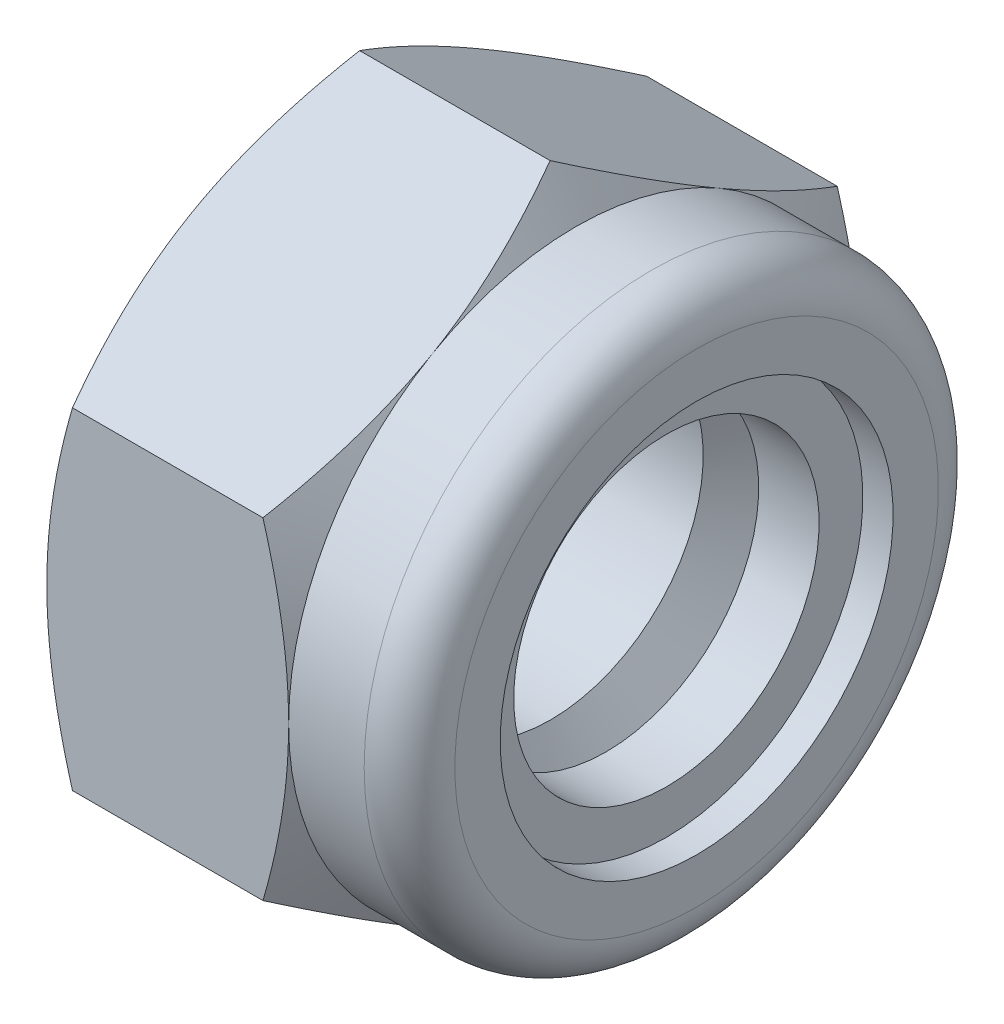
ISO-10303-21;
HEADER;
FILE_DESCRIPTION(('STEP AP214'),'2;1');
FILE_NAME('part.step','',(''),(''),'','','');
FILE_SCHEMA(('AUTOMOTIVE_DESIGN { 1 0 10303 214 1 1 1 1 }'));
ENDSEC;
DATA;
#1=APPLICATION_CONTEXT('core data for automotive mechanical design processes');
#2=APPLICATION_PROTOCOL_DEFINITION('international standard','automotive_design',2000,#1);
#3=PRODUCT_CONTEXT('',#1,'mechanical');
#4=PRODUCT('Part','Part','',(#3));
#5=PRODUCT_RELATED_PRODUCT_CATEGORY('part','',(#4));
#6=PRODUCT_DEFINITION_FORMATION('','',#4);
#7=PRODUCT_DEFINITION_CONTEXT('part definition',#1,'design');
#8=PRODUCT_DEFINITION('design','',#6,#7);
#9=PRODUCT_DEFINITION_SHAPE('','',#8);
#10=(LENGTH_UNIT() NAMED_UNIT(*) SI_UNIT(.MILLI.,.METRE.));
#11=(NAMED_UNIT(*) PLANE_ANGLE_UNIT() SI_UNIT($,.RADIAN.));
#12=(NAMED_UNIT(*) SI_UNIT($,.STERADIAN.) SOLID_ANGLE_UNIT());
#13=UNCERTAINTY_MEASURE_WITH_UNIT(LENGTH_MEASURE(1.E-05),#10,'distance_accuracy_value','');
#14=(GEOMETRIC_REPRESENTATION_CONTEXT(3) GLOBAL_UNCERTAINTY_ASSIGNED_CONTEXT((#13)) GLOBAL_UNIT_ASSIGNED_CONTEXT((#10,
#11,#12)) REPRESENTATION_CONTEXT('',''));
#15=CARTESIAN_POINT('',(0.,0.,0.));
#16=DIRECTION('',(0.,0.,1.));
#17=DIRECTION('',(1.,0.,0.));
#18=AXIS2_PLACEMENT_3D('',#15,#16,#17);
#19=CARTESIAN_POINT('',(8.,0.,0.));
#20=DIRECTION('',(-1.,0.,0.));
#21=DIRECTION('',(0.,-1.,0.));
#22=AXIS2_PLACEMENT_3D('',#19,#20,#21);
#23=CONICAL_SURFACE('',#22,9.5,1.0471975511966);
#24=CARTESIAN_POINT('',(7.15142755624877,-10.9697705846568,-0.0002));
#25=CARTESIAN_POINT('',(7.22102656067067,-10.8492020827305,0.2086307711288));
#26=CARTESIAN_POINT('',(7.28746669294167,-10.7281840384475,0.418240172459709));
#27=CARTESIAN_POINT('',(7.41315271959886,-10.4851774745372,0.839139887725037));
#28=CARTESIAN_POINT('',(7.47239624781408,-10.3631886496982,1.05043073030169));
#29=CARTESIAN_POINT('',(7.63818542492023,-9.99525656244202,1.68770779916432));
#30=CARTESIAN_POINT('',(7.73248555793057,-9.74786083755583,2.11620976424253));
#31=CARTESIAN_POINT('',(7.84306129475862,-9.37764446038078,2.75744333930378));
#32=CARTESIAN_POINT('',(7.8745601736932,-9.25592985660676,2.96825921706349));
#33=CARTESIAN_POINT('',(7.92738179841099,-9.01193711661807,3.39086703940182));
#34=CARTESIAN_POINT('',(7.9487043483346,-8.88965896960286,3.60265900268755));
#35=CARTESIAN_POINT('',(7.98062697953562,-8.64489870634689,4.0265962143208));
#36=CARTESIAN_POINT('',(7.99123980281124,-8.5224170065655,4.23874074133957));
#37=CARTESIAN_POINT('',(8.00151746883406,-8.27734047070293,4.66322575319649));
#38=CARTESIAN_POINT('',(8.00118264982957,-8.15474563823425,4.87556623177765));
#39=CARTESIAN_POINT('',(7.99032663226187,-7.92555157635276,5.27254199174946));
#40=CARTESIAN_POINT('',(7.98112973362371,-7.81893617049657,5.45720529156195));
#41=CARTESIAN_POINT('',(7.95463460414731,-7.60595470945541,5.82610000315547));
#42=CARTESIAN_POINT('',(7.93733580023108,-7.49958867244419,6.01033138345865));
#43=CARTESIAN_POINT('',(7.87369551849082,-7.18090270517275,6.56231167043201));
#44=CARTESIAN_POINT('',(7.81561809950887,-6.96914687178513,6.92908353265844));
#45=CARTESIAN_POINT('',(7.67042398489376,-6.54338898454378,7.66651782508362));
#46=CARTESIAN_POINT('',(7.58269183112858,-6.32944126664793,8.03708614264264));
#47=CARTESIAN_POINT('',(7.38357626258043,-5.90473630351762,8.77269671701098));
#48=CARTESIAN_POINT('',(7.27223961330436,-5.69397361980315,9.137748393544));
#49=CARTESIAN_POINT('',(7.15142755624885,-5.48471208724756,9.5002));
#50=B_SPLINE_CURVE_WITH_KNOTS('',3,(#24,#25,#26,#27,#28,#29,#30,#31,#32,#33,#34,#35,#36,#37,#38,
#39,#40,#41,#42,#43,#44,#45,#46,#47,#48,#49),.UNSPECIFIED.,.F.,.F.,(4,2,2,2,2,2,2,2,2,2,2,2,4),
(0.,0.752880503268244,1.50600787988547,3.01546870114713,3.75167336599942,4.4878921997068,
5.22323407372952,5.95855322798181,6.59868084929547,7.23885375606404,8.52010929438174,
9.82978009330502,11.1368800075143),.UNSPECIFIED.);
#51=CARTESIAN_POINT('',(7.15149422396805,-10.969655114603,0.));
#52=VERTEX_POINT('',#51);
#53=CARTESIAN_POINT('',(7.99999999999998,-8.22724133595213,4.75000000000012));
#54=VERTEX_POINT('',#53);
#55=EDGE_CURVE('E230',#52,#54,#50,.T.);
#56=ORIENTED_EDGE('',*,*,#55,.F.);
#57=CARTESIAN_POINT('',(7.15142755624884,-5.48471208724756,-9.5002));
#58=CARTESIAN_POINT('',(7.22102656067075,-5.60528058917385,-9.2913692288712));
#59=CARTESIAN_POINT('',(7.28746669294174,-5.72629863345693,-9.0817598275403));
#60=CARTESIAN_POINT('',(7.41315271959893,-5.96930519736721,-8.66086011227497));
#61=CARTESIAN_POINT('',(7.47239624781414,-6.09129402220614,-8.44956926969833));
#62=CARTESIAN_POINT('',(7.63818542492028,-6.45922610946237,-7.8122922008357));
#63=CARTESIAN_POINT('',(7.73248555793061,-6.70662183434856,-7.38379023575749));
#64=CARTESIAN_POINT('',(7.84306129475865,-7.0768382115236,-6.74255666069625));
#65=CARTESIAN_POINT('',(7.87456017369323,-7.19855281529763,-6.53174078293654));
#66=CARTESIAN_POINT('',(7.92738179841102,-7.44254555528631,-6.10913296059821));
#67=CARTESIAN_POINT('',(7.94870434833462,-7.56482370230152,-5.89734099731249));
#68=CARTESIAN_POINT('',(7.98062697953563,-7.80958396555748,-5.47340378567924));
#69=CARTESIAN_POINT('',(7.99123980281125,-7.93206566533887,-5.26125925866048));
#70=CARTESIAN_POINT('',(8.00151746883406,-8.17714220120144,-4.83677424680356));
#71=CARTESIAN_POINT('',(8.00118264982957,-8.29973703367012,-4.6244337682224));
#72=CARTESIAN_POINT('',(7.99032663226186,-8.52893109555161,-4.22745800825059));
#73=CARTESIAN_POINT('',(7.9811297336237,-8.6355465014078,-4.0427947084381));
#74=CARTESIAN_POINT('',(7.95463460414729,-8.84852796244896,-3.67389999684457));
#75=CARTESIAN_POINT('',(7.93733580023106,-8.95489399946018,-3.48966861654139));
#76=CARTESIAN_POINT('',(7.87369551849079,-9.27357996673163,-2.93768832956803));
#77=CARTESIAN_POINT('',(7.81561809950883,-9.48533580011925,-2.57091646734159));
#78=CARTESIAN_POINT('',(7.67042398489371,-9.9110936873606,-1.8334821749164));
#79=CARTESIAN_POINT('',(7.58269183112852,-10.1250414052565,-1.46291385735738));
#80=CARTESIAN_POINT('',(7.38357626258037,-10.5497463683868,-0.727303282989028));
#81=CARTESIAN_POINT('',(7.27223961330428,-10.7605090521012,-0.362251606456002));
#82=CARTESIAN_POINT('',(7.15142755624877,-10.9697705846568,0.000200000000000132));
#83=B_SPLINE_CURVE_WITH_KNOTS('',3,(#57,#58,#59,#60,#61,#62,#63,#64,#65,#66,#67,#68,#69,#70,#71,
#72,#73,#74,#75,#76,#77,#78,#79,#80,#81,#82),.UNSPECIFIED.,.F.,.F.,(4,2,2,2,2,2,2,2,2,2,2,2,4),
(0.,0.752880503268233,1.50600787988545,3.01546870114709,3.75167336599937,4.48789219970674,
5.22323407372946,5.95855322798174,6.59868084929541,7.23885375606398,8.52010929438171,
9.829780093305,11.1368800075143),.UNSPECIFIED.);
#84=CARTESIAN_POINT('',(7.99999999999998,-8.22724133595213,-4.75000000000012));
#85=VERTEX_POINT('',#84);
#86=EDGE_CURVE('E335',#85,#52,#83,.T.);
#87=ORIENTED_EDGE('',*,*,#86,.F.);
#88=CARTESIAN_POINT('',(8.,0.,0.));
#89=DIRECTION('',(1.,0.,0.));
#90=DIRECTION('',(0.,1.,0.));
#91=AXIS2_PLACEMENT_3D('',#88,#89,#90);
#92=CIRCLE('',#91,9.5);
#93=EDGE_CURVE('E361',#54,#85,#92,.T.);
#94=ORIENTED_EDGE('',*,*,#93,.F.);
#95=EDGE_LOOP('',(#56,#87,#94));
#96=FACE_BOUND('',#95,.T.);
#97=ADVANCED_FACE('F35',(#96),#23,.T.);
#98=CARTESIAN_POINT('',(7.15149422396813,-5.4848275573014,9.5));
#99=VERTEX_POINT('',#98);
#100=EDGE_CURVE('E231',#54,#99,#50,.T.);
#101=ORIENTED_EDGE('',*,*,#100,.F.);
#102=CARTESIAN_POINT('',(8.,0.,9.5));
#103=VERTEX_POINT('',#102);
#104=EDGE_CURVE('E248',#103,#54,#92,.T.);
#105=ORIENTED_EDGE('',*,*,#104,.F.);
#106=CARTESIAN_POINT('',(3.32587526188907,-14.8109059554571,9.5));
#107=CARTESIAN_POINT('',(3.42684938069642,-14.6031243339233,9.5));
#108=CARTESIAN_POINT('',(3.52732586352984,-14.3951009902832,9.5));
#109=CARTESIAN_POINT('',(3.72717100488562,-13.9785204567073,9.5));
#110=CARTESIAN_POINT('',(3.82653965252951,-13.7699632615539,9.5));
#111=CARTESIAN_POINT('',(4.12284070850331,-13.1433608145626,9.5));
#112=CARTESIAN_POINT('',(4.31793886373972,-12.7244449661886,9.5));
#113=CARTESIAN_POINT('',(4.70311268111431,-11.8815931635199,9.5));
#114=CARTESIAN_POINT('',(4.89315588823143,-11.4576423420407,9.5));
#115=CARTESIAN_POINT('',(5.26557199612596,-10.6063967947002,9.5));
#116=CARTESIAN_POINT('',(5.44794525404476,-10.1791022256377,9.5));
#117=CARTESIAN_POINT('',(5.80882953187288,-9.30637765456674,9.5));
#118=CARTESIAN_POINT('',(5.98701680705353,-8.86081304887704,9.5));
#119=CARTESIAN_POINT('',(6.33009368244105,-7.96450097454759,9.5));
#120=CARTESIAN_POINT('',(6.49498180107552,-7.51375293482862,9.5));
#121=CARTESIAN_POINT('',(6.80718793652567,-6.60717020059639,9.5));
#122=CARTESIAN_POINT('',(6.95454086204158,-6.1513476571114,9.5));
#123=CARTESIAN_POINT('',(7.22700160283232,-5.23318024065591,9.5));
#124=CARTESIAN_POINT('',(7.35211634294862,-4.77083744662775,9.5));
#125=CARTESIAN_POINT('',(7.57346743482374,-3.84188418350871,9.5));
#126=CARTESIAN_POINT('',(7.66986394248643,-3.37531292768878,9.5));
#127=CARTESIAN_POINT('',(7.78878967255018,-2.67114536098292,9.5));
#128=CARTESIAN_POINT('',(7.82415499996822,-2.43568762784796,9.5));
#129=CARTESIAN_POINT('',(7.88563753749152,-1.96357546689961,9.5));
#130=CARTESIAN_POINT('',(7.9117556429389,-1.72692115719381,9.5));
#131=CARTESIAN_POINT('',(7.95389172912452,-1.25585831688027,9.5));
#132=CARTESIAN_POINT('',(7.97003840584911,-1.02146134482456,9.5));
#133=CARTESIAN_POINT('',(7.99240100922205,-0.552194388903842,9.5));
#134=CARTESIAN_POINT('',(7.99861710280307,-0.317324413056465,9.5));
#135=CARTESIAN_POINT('',(8.00096998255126,0.152467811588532,9.5));
#136=CARTESIAN_POINT('',(7.99710676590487,0.387390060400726,9.5));
#137=CARTESIAN_POINT('',(7.97939653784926,0.856860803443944,9.5));
#138=CARTESIAN_POINT('',(7.96554904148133,1.09140927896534,9.5));
#139=CARTESIAN_POINT('',(7.9207543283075,1.65276277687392,9.5));
#140=CARTESIAN_POINT('',(7.8851998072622,1.97920812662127,9.5));
#141=CARTESIAN_POINT('',(7.79667223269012,2.62971151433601,9.5));
#142=CARTESIAN_POINT('',(7.74369687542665,2.95376923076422,9.5));
#143=CARTESIAN_POINT('',(7.56144549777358,3.92197165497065,9.5));
#144=CARTESIAN_POINT('',(7.40887618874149,4.56179172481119,9.5));
#145=CARTESIAN_POINT('',(7.1438532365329,5.51856895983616,9.5));
#146=CARTESIAN_POINT('',(7.0482419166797,5.84047729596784,9.5));
#147=CARTESIAN_POINT('',(6.84697300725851,6.48116865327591,9.5));
#148=CARTESIAN_POINT('',(6.74131535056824,6.7999516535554,9.5));
#149=CARTESIAN_POINT('',(6.52165855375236,7.43449001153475,9.5));
#150=CARTESIAN_POINT('',(6.4076620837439,7.7502463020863,9.5));
#151=CARTESIAN_POINT('',(6.17268042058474,8.37913534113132,9.5));
#152=CARTESIAN_POINT('',(6.05169531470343,8.69226812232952,9.5));
#153=CARTESIAN_POINT('',(5.75526512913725,9.43864227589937,9.5));
#154=CARTESIAN_POINT('',(5.57708060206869,9.87079371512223,9.5));
#155=CARTESIAN_POINT('',(5.2118441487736,10.7313446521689,9.5));
#156=CARTESIAN_POINT('',(5.02479164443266,11.1597439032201,9.5));
#157=CARTESIAN_POINT('',(4.64361839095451,12.013500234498,9.5));
#158=CARTESIAN_POINT('',(4.44949596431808,12.4388565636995,9.5));
#159=CARTESIAN_POINT('',(4.05562918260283,13.2869398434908,9.5));
#160=CARTESIAN_POINT('',(3.85588495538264,13.7096668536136,9.5));
#161=CARTESIAN_POINT('',(3.45160745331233,14.5534173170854,9.5));
#162=CARTESIAN_POINT('',(3.24706894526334,14.9744382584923,9.5));
#163=CARTESIAN_POINT('',(2.83425219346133,15.8146424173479,9.5));
#164=CARTESIAN_POINT('',(2.62597393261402,16.2338256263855,9.5));
#165=CARTESIAN_POINT('',(2.20635515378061,17.0705826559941,9.5));
#166=CARTESIAN_POINT('',(1.99501506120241,17.488156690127,9.5));
#167=CARTESIAN_POINT('',(1.56975130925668,18.3219878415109,9.5));
#168=CARTESIAN_POINT('',(1.35582763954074,18.7382449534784,9.5));
#169=CARTESIAN_POINT('',(0.747658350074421,19.9140885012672,9.5));
#170=CARTESIAN_POINT('',(0.350874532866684,20.672362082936,9.5));
#171=CARTESIAN_POINT('',(-0.448092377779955,22.1860890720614,9.5));
#172=CARTESIAN_POINT('',(-0.850275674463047,22.9415423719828,9.5));
#173=CARTESIAN_POINT('',(-1.65771725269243,24.4482793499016,9.5));
#174=CARTESIAN_POINT('',(-2.06296484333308,25.199568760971,9.5));
#175=CARTESIAN_POINT('',(-2.67322884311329,26.3251763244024,9.5));
#176=CARTESIAN_POINT('',(-2.87704315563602,26.700147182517,9.5));
#177=CARTESIAN_POINT('',(-3.28538920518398,27.4496973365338,9.5));
#178=CARTESIAN_POINT('',(-3.4899209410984,27.8242766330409,9.5));
#179=CARTESIAN_POINT('',(-3.6947697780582,28.1986824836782,9.5));
#180=B_SPLINE_CURVE_WITH_KNOTS('',3,(#106,#107,#108,#109,#110,#111,#112,#113,#114,#115,#116,
#117,#118,#119,#120,#121,#122,#123,#124,#125,#126,#127,#128,#129,#130,#131,#132,#133,#134,#135,
#136,#137,#138,#139,#140,#141,#142,#143,#144,#145,#146,#147,#148,#149,#150,#151,#152,#153,#154,
#155,#156,#157,#158,#159,#160,#161,#162,#163,#164,#165,#166,#167,#168,#169,#170,#171,#172,#173,
#174,#175,#176,#177,#178,#179),.UNSPECIFIED.,.F.,.F.,(4,2,2,2,2,2,2,2,2,2,2,2,2,2,2,2,2,2,2,2,2,
2,2,2,2,2,2,2,2,2,2,2,2,2,2,2,4),(0.,0.69305055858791,1.38610791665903,2.77242373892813,
4.16615644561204,5.55982418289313,6.99927980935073,8.43889557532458,9.87559566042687,
11.3118475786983,12.7399330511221,13.4540765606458,14.1681509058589,14.8728051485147,
15.5774475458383,16.2820901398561,16.9867669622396,17.9713396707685,18.9560426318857,
20.9265098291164,21.9338457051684,22.9411883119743,23.9482097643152,24.9552186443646,
26.3574183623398,27.7597096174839,29.162335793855,30.5649300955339,31.9691341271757,
33.3733445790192,34.7773617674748,36.1813845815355,38.7487911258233,41.3162945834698,
43.877133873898,45.1574812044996,46.4378265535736),.UNSPECIFIED.);
#181=EDGE_CURVE('E139',#99,#103,#180,.T.);
#182=ORIENTED_EDGE('',*,*,#181,.F.);
#183=EDGE_LOOP('',(#101,#105,#182));
#184=FACE_BOUND('',#183,.T.);
#185=ADVANCED_FACE('F294',(#184),#23,.T.);
#186=CARTESIAN_POINT('',(7.15149422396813,5.4848275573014,9.5));
#187=VERTEX_POINT('',#186);
#188=EDGE_CURVE('E225',#103,#187,#180,.T.);
#189=ORIENTED_EDGE('',*,*,#188,.F.);
#190=CARTESIAN_POINT('',(7.99999999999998,8.22724133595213,4.75000000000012));
#191=VERTEX_POINT('',#190);
#192=EDGE_CURVE('E244',#191,#103,#92,.T.);
#193=ORIENTED_EDGE('',*,*,#192,.F.);
#194=CARTESIAN_POINT('',(7.15142755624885,5.48471208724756,9.5002));
#195=CARTESIAN_POINT('',(7.22102656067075,5.60528058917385,9.2913692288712));
#196=CARTESIAN_POINT('',(7.28746669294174,5.72629863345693,9.0817598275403));
#197=CARTESIAN_POINT('',(7.41315271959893,5.96930519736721,8.66086011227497));
#198=CARTESIAN_POINT('',(7.47239624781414,6.09129402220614,8.44956926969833));
#199=CARTESIAN_POINT('',(7.63818542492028,6.45922610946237,7.8122922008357));
#200=CARTESIAN_POINT('',(7.73248555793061,6.70662183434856,7.38379023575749));
#201=CARTESIAN_POINT('',(7.84306129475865,7.0768382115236,6.74255666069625));
#202=CARTESIAN_POINT('',(7.87456017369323,7.19855281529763,6.53174078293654));
#203=CARTESIAN_POINT('',(7.92738179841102,7.44254555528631,6.10913296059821));
#204=CARTESIAN_POINT('',(7.94870434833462,7.56482370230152,5.89734099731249));
#205=CARTESIAN_POINT('',(7.98062697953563,7.80958396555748,5.47340378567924));
#206=CARTESIAN_POINT('',(7.99123980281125,7.93206566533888,5.26125925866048));
#207=CARTESIAN_POINT('',(8.00151746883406,8.17714220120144,4.83677424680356));
#208=CARTESIAN_POINT('',(8.00118264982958,8.29973703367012,4.6244337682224));
#209=CARTESIAN_POINT('',(7.99032663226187,8.52893109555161,4.22745800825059));
#210=CARTESIAN_POINT('',(7.9811297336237,8.6355465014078,4.0427947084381));
#211=CARTESIAN_POINT('',(7.9546346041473,8.84852796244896,3.67389999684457));
#212=CARTESIAN_POINT('',(7.93733580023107,8.95489399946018,3.48966861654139));
#213=CARTESIAN_POINT('',(7.87369551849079,9.27357996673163,2.93768832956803));
#214=CARTESIAN_POINT('',(7.81561809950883,9.48533580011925,2.57091646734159));
#215=CARTESIAN_POINT('',(7.67042398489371,9.9110936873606,1.8334821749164));
#216=CARTESIAN_POINT('',(7.58269183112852,10.1250414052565,1.46291385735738));
#217=CARTESIAN_POINT('',(7.38357626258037,10.5497463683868,0.727303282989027));
#218=CARTESIAN_POINT('',(7.27223961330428,10.7605090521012,0.362251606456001));
#219=CARTESIAN_POINT('',(7.15142755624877,10.9697705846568,-0.000200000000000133));
#220=B_SPLINE_CURVE_WITH_KNOTS('',3,(#194,#195,#196,#197,#198,#199,#200,#201,#202,#203,#204,
#205,#206,#207,#208,#209,#210,#211,#212,#213,#214,#215,#216,#217,#218,#219),.UNSPECIFIED.,.F.,
.F.,(4,2,2,2,2,2,2,2,2,2,2,2,4),(0.,0.752880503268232,1.50600787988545,3.01546870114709,
3.75167336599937,4.48789219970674,5.22323407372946,5.95855322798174,6.59868084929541,
7.23885375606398,8.52010929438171,9.829780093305,11.1368800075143),.UNSPECIFIED.);
#221=EDGE_CURVE('E135',#187,#191,#220,.T.);
#222=ORIENTED_EDGE('',*,*,#221,.F.);
#223=EDGE_LOOP('',(#189,#193,#222));
#224=FACE_BOUND('',#223,.T.);
#225=ADVANCED_FACE('F299',(#224),#23,.T.);
#226=CARTESIAN_POINT('',(7.15149422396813,-5.4848275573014,-9.5));
#227=VERTEX_POINT('',#226);
#228=EDGE_CURVE('E327',#227,#85,#83,.T.);
#229=ORIENTED_EDGE('',*,*,#228,.F.);
#230=CARTESIAN_POINT('',(3.32587526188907,-14.8109059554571,-9.5));
#231=CARTESIAN_POINT('',(3.42684938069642,-14.6031243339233,-9.5));
#232=CARTESIAN_POINT('',(3.52732586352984,-14.3951009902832,-9.5));
#233=CARTESIAN_POINT('',(3.72717100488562,-13.9785204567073,-9.5));
#234=CARTESIAN_POINT('',(3.82653965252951,-13.7699632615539,-9.5));
#235=CARTESIAN_POINT('',(4.12284070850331,-13.1433608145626,-9.5));
#236=CARTESIAN_POINT('',(4.31793886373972,-12.7244449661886,-9.5));
#237=CARTESIAN_POINT('',(4.70311268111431,-11.8815931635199,-9.5));
#238=CARTESIAN_POINT('',(4.89315588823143,-11.4576423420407,-9.5));
#239=CARTESIAN_POINT('',(5.26557199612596,-10.6063967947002,-9.5));
#240=CARTESIAN_POINT('',(5.44794525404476,-10.1791022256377,-9.5));
#241=CARTESIAN_POINT('',(5.80882953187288,-9.30637765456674,-9.5));
#242=CARTESIAN_POINT('',(5.98701680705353,-8.86081304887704,-9.5));
#243=CARTESIAN_POINT('',(6.33009368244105,-7.96450097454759,-9.5));
#244=CARTESIAN_POINT('',(6.49498180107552,-7.51375293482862,-9.5));
#245=CARTESIAN_POINT('',(6.80718793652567,-6.60717020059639,-9.5));
#246=CARTESIAN_POINT('',(6.95454086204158,-6.1513476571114,-9.5));
#247=CARTESIAN_POINT('',(7.22700160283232,-5.23318024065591,-9.5));
#248=CARTESIAN_POINT('',(7.35211634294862,-4.77083744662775,-9.5));
#249=CARTESIAN_POINT('',(7.57346743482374,-3.84188418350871,-9.5));
#250=CARTESIAN_POINT('',(7.66986394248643,-3.37531292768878,-9.5));
#251=CARTESIAN_POINT('',(7.78878967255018,-2.67114536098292,-9.5));
#252=CARTESIAN_POINT('',(7.82415499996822,-2.43568762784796,-9.5));
#253=CARTESIAN_POINT('',(7.88563753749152,-1.96357546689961,-9.5));
#254=CARTESIAN_POINT('',(7.9117556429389,-1.72692115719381,-9.5));
#255=CARTESIAN_POINT('',(7.95389172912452,-1.25585831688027,-9.5));
#256=CARTESIAN_POINT('',(7.97003840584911,-1.02146134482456,-9.5));
#257=CARTESIAN_POINT('',(7.99240100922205,-0.552194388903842,-9.5));
#258=CARTESIAN_POINT('',(7.99861710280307,-0.317324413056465,-9.5));
#259=CARTESIAN_POINT('',(8.00096998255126,0.152467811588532,-9.5));
#260=CARTESIAN_POINT('',(7.99710676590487,0.387390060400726,-9.5));
#261=CARTESIAN_POINT('',(7.97939653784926,0.856860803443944,-9.5));
#262=CARTESIAN_POINT('',(7.96554904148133,1.09140927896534,-9.5));
#263=CARTESIAN_POINT('',(7.9207543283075,1.65276277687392,-9.5));
#264=CARTESIAN_POINT('',(7.8851998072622,1.97920812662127,-9.5));
#265=CARTESIAN_POINT('',(7.79667223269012,2.62971151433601,-9.5));
#266=CARTESIAN_POINT('',(7.74369687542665,2.95376923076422,-9.5));
#267=CARTESIAN_POINT('',(7.56144549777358,3.92197165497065,-9.5));
#268=CARTESIAN_POINT('',(7.40887618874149,4.56179172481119,-9.5));
#269=CARTESIAN_POINT('',(7.1438532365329,5.51856895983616,-9.5));
#270=CARTESIAN_POINT('',(7.0482419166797,5.84047729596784,-9.5));
#271=CARTESIAN_POINT('',(6.84697300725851,6.48116865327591,-9.5));
#272=CARTESIAN_POINT('',(6.74131535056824,6.7999516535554,-9.5));
#273=CARTESIAN_POINT('',(6.52165855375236,7.43449001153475,-9.5));
#274=CARTESIAN_POINT('',(6.4076620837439,7.7502463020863,-9.5));
#275=CARTESIAN_POINT('',(6.17268042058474,8.37913534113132,-9.5));
#276=CARTESIAN_POINT('',(6.05169531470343,8.69226812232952,-9.5));
#277=CARTESIAN_POINT('',(5.75526512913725,9.43864227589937,-9.5));
#278=CARTESIAN_POINT('',(5.57708060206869,9.87079371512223,-9.5));
#279=CARTESIAN_POINT('',(5.2118441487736,10.7313446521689,-9.5));
#280=CARTESIAN_POINT('',(5.02479164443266,11.1597439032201,-9.5));
#281=CARTESIAN_POINT('',(4.64361839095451,12.013500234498,-9.5));
#282=CARTESIAN_POINT('',(4.44949596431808,12.4388565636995,-9.5));
#283=CARTESIAN_POINT('',(4.05562918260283,13.2869398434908,-9.5));
#284=CARTESIAN_POINT('',(3.85588495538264,13.7096668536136,-9.5));
#285=CARTESIAN_POINT('',(3.45160745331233,14.5534173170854,-9.5));
#286=CARTESIAN_POINT('',(3.24706894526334,14.9744382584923,-9.5));
#287=CARTESIAN_POINT('',(2.83425219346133,15.8146424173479,-9.5));
#288=CARTESIAN_POINT('',(2.62597393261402,16.2338256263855,-9.5));
#289=CARTESIAN_POINT('',(2.20635515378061,17.0705826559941,-9.5));
#290=CARTESIAN_POINT('',(1.99501506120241,17.488156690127,-9.5));
#291=CARTESIAN_POINT('',(1.56975130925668,18.3219878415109,-9.5));
#292=CARTESIAN_POINT('',(1.35582763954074,18.7382449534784,-9.5));
#293=CARTESIAN_POINT('',(0.747658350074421,19.9140885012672,-9.5));
#294=CARTESIAN_POINT('',(0.350874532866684,20.672362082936,-9.5));
#295=CARTESIAN_POINT('',(-0.448092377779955,22.1860890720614,-9.5));
#296=CARTESIAN_POINT('',(-0.850275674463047,22.9415423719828,-9.5));
#297=CARTESIAN_POINT('',(-1.65771725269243,24.4482793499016,-9.5));
#298=CARTESIAN_POINT('',(-2.06296484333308,25.199568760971,-9.5));
#299=CARTESIAN_POINT('',(-2.67322884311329,26.3251763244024,-9.5));
#300=CARTESIAN_POINT('',(-2.87704315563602,26.700147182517,-9.5));
#301=CARTESIAN_POINT('',(-3.28538920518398,27.4496973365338,-9.5));
#302=CARTESIAN_POINT('',(-3.4899209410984,27.8242766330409,-9.5));
#303=CARTESIAN_POINT('',(-3.6947697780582,28.1986824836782,-9.5));
#304=B_SPLINE_CURVE_WITH_KNOTS('',3,(#230,#231,#232,#233,#234,#235,#236,#237,#238,#239,#240,
#241,#242,#243,#244,#245,#246,#247,#248,#249,#250,#251,#252,#253,#254,#255,#256,#257,#258,#259,
#260,#261,#262,#263,#264,#265,#266,#267,#268,#269,#270,#271,#272,#273,#274,#275,#276,#277,#278,
#279,#280,#281,#282,#283,#284,#285,#286,#287,#288,#289,#290,#291,#292,#293,#294,#295,#296,#297,
#298,#299,#300,#301,#302,#303),.UNSPECIFIED.,.F.,.F.,(4,2,2,2,2,2,2,2,2,2,2,2,2,2,2,2,2,2,2,2,2,
2,2,2,2,2,2,2,2,2,2,2,2,2,2,2,4),(0.,0.69305055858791,1.38610791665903,2.77242373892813,
4.16615644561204,5.55982418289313,6.99927980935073,8.43889557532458,9.87559566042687,
11.3118475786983,12.7399330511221,13.4540765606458,14.1681509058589,14.8728051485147,
15.5774475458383,16.2820901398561,16.9867669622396,17.9713396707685,18.9560426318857,
20.9265098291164,21.9338457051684,22.9411883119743,23.9482097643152,24.9552186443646,
26.3574183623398,27.7597096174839,29.162335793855,30.5649300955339,31.9691341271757,
33.3733445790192,34.7773617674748,36.1813845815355,38.7487911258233,41.3162945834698,
43.877133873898,45.1574812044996,46.4378265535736),.UNSPECIFIED.);
#305=CARTESIAN_POINT('',(8.,0.,-9.5));
#306=VERTEX_POINT('',#305);
#307=EDGE_CURVE('E148',#306,#227,#304,.F.);
#308=ORIENTED_EDGE('',*,*,#307,.F.);
#309=EDGE_CURVE('E330',#85,#306,#92,.T.);
#310=ORIENTED_EDGE('',*,*,#309,.F.);
#311=EDGE_LOOP('',(#229,#308,#310));
#312=FACE_BOUND('',#311,.T.);
#313=ADVANCED_FACE('F312',(#312),#23,.T.);
#314=CARTESIAN_POINT('',(7.15149422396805,10.969655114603,0.));
#315=VERTEX_POINT('',#314);
#316=EDGE_CURVE('E129',#191,#315,#220,.T.);
#317=ORIENTED_EDGE('',*,*,#316,.F.);
#318=CARTESIAN_POINT('',(8.,8.22724133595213,-4.75000000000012));
#319=VERTEX_POINT('',#318);
#320=EDGE_CURVE('E146',#319,#191,#92,.T.);
#321=ORIENTED_EDGE('',*,*,#320,.F.);
#322=CARTESIAN_POINT('',(7.15142755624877,10.9697705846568,0.0002));
#323=CARTESIAN_POINT('',(7.22102656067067,10.8492020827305,-0.2086307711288));
#324=CARTESIAN_POINT('',(7.28746669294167,10.7281840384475,-0.418240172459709));
#325=CARTESIAN_POINT('',(7.41315271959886,10.4851774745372,-0.839139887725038));
#326=CARTESIAN_POINT('',(7.47239624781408,10.3631886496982,-1.05043073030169));
#327=CARTESIAN_POINT('',(7.63818542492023,9.99525656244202,-1.68770779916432));
#328=CARTESIAN_POINT('',(7.73248555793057,9.74786083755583,-2.11620976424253));
#329=CARTESIAN_POINT('',(7.84306129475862,9.37764446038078,-2.75744333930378));
#330=CARTESIAN_POINT('',(7.8745601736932,9.25592985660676,-2.96825921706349));
#331=CARTESIAN_POINT('',(7.92738179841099,9.01193711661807,-3.39086703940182));
#332=CARTESIAN_POINT('',(7.9487043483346,8.88965896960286,-3.60265900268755));
#333=CARTESIAN_POINT('',(7.98062697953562,8.64489870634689,-4.0265962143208));
#334=CARTESIAN_POINT('',(7.99123980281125,8.5224170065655,-4.23874074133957));
#335=CARTESIAN_POINT('',(8.00151746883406,8.27734047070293,-4.66322575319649));
#336=CARTESIAN_POINT('',(8.00118264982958,8.15474563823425,-4.87556623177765));
#337=CARTESIAN_POINT('',(7.99032663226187,7.92555157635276,-5.27254199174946));
#338=CARTESIAN_POINT('',(7.98112973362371,7.81893617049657,-5.45720529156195));
#339=CARTESIAN_POINT('',(7.95463460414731,7.60595470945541,-5.82610000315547));
#340=CARTESIAN_POINT('',(7.93733580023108,7.49958867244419,-6.01033138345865));
#341=CARTESIAN_POINT('',(7.87369551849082,7.18090270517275,-6.56231167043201));
#342=CARTESIAN_POINT('',(7.81561809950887,6.96914687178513,-6.92908353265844));
#343=CARTESIAN_POINT('',(7.67042398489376,6.54338898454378,-7.66651782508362));
#344=CARTESIAN_POINT('',(7.58269183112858,6.32944126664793,-8.03708614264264));
#345=CARTESIAN_POINT('',(7.38357626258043,5.90473630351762,-8.77269671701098));
#346=CARTESIAN_POINT('',(7.27223961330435,5.69397361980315,-9.13774839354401));
#347=CARTESIAN_POINT('',(7.15142755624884,5.48471208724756,-9.5002));
#348=B_SPLINE_CURVE_WITH_KNOTS('',3,(#322,#323,#324,#325,#326,#327,#328,#329,#330,#331,#332,
#333,#334,#335,#336,#337,#338,#339,#340,#341,#342,#343,#344,#345,#346,#347),.UNSPECIFIED.,.F.,
.F.,(4,2,2,2,2,2,2,2,2,2,2,2,4),(0.,0.752880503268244,1.50600787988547,3.01546870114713,
3.75167336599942,4.4878921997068,5.22323407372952,5.95855322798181,6.59868084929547,
7.23885375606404,8.52010929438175,9.82978009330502,11.1368800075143),.UNSPECIFIED.);
#349=EDGE_CURVE('E55',#315,#319,#348,.T.);
#350=ORIENTED_EDGE('',*,*,#349,.F.);
#351=EDGE_LOOP('',(#317,#321,#350));
#352=FACE_BOUND('',#351,.T.);
#353=ADVANCED_FACE('F145',(#352),#23,.T.);
#354=CARTESIAN_POINT('',(2.7424137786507,0.,0.));
#355=DIRECTION('',(1.,0.,0.));
#356=DIRECTION('',(0.,1.,0.));
#357=AXIS2_PLACEMENT_3D('',#354,#355,#356);
#358=CONICAL_SURFACE('',#357,14.25,1.0471975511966);
#359=CARTESIAN_POINT('',(0.848572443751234,10.9697705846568,-0.000200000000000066));
#360=CARTESIAN_POINT('',(0.778973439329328,10.8492020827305,0.2086307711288));
#361=CARTESIAN_POINT('',(0.71253330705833,10.7281840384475,0.418240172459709));
#362=CARTESIAN_POINT('',(0.586847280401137,10.4851774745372,0.839139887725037));
#363=CARTESIAN_POINT('',(0.527603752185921,10.3631886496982,1.05043073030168));
#364=CARTESIAN_POINT('',(0.361814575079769,9.99525656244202,1.68770779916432));
#365=CARTESIAN_POINT('',(0.267514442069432,9.74786083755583,2.11620976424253));
#366=CARTESIAN_POINT('',(0.156938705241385,9.37764446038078,2.75744333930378));
#367=CARTESIAN_POINT('',(0.125439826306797,9.25592985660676,2.96825921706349));
#368=CARTESIAN_POINT('',(0.0726182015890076,9.01193711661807,3.39086703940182));
#369=CARTESIAN_POINT('',(0.0512956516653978,8.88965896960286,3.60265900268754));
#370=CARTESIAN_POINT('',(0.0193730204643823,8.64489870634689,4.0265962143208));
#371=CARTESIAN_POINT('',(0.00876019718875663,8.5224170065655,4.23874074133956));
#372=CARTESIAN_POINT('',(-0.00151746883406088,8.27734047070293,4.66322575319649));
#373=CARTESIAN_POINT('',(-0.00118264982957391,8.15474563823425,4.87556623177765));
#374=CARTESIAN_POINT('',(0.00967336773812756,7.92555157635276,5.27254199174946));
#375=CARTESIAN_POINT('',(0.0188702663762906,7.81893617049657,5.45720529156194));
#376=CARTESIAN_POINT('',(0.0453653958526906,7.60595470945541,5.82610000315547));
#377=CARTESIAN_POINT('',(0.0626641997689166,7.49958867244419,6.01033138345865));
#378=CARTESIAN_POINT('',(0.12630448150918,7.18090270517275,6.56231167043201));
#379=CARTESIAN_POINT('',(0.184381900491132,6.96914687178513,6.92908353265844));
#380=CARTESIAN_POINT('',(0.329576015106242,6.54338898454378,7.66651782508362));
#381=CARTESIAN_POINT('',(0.417308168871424,6.32944126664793,8.03708614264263));
#382=CARTESIAN_POINT('',(0.616423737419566,5.90473630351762,8.77269671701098));
#383=CARTESIAN_POINT('',(0.727760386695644,5.69397361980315,9.137748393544));
#384=CARTESIAN_POINT('',(0.848572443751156,5.48471208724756,9.5002));
#385=B_SPLINE_CURVE_WITH_KNOTS('',3,(#359,#360,#361,#362,#363,#364,#365,#366,#367,#368,#369,
#370,#371,#372,#373,#374,#375,#376,#377,#378,#379,#380,#381,#382,#383,#384),.UNSPECIFIED.,.F.,
.F.,(4,2,2,2,2,2,2,2,2,2,2,2,4),(0.,0.752880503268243,1.50600787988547,3.01546870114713,
3.75167336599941,4.4878921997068,5.22323407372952,5.95855322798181,6.59868084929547,
7.23885375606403,8.52010929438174,9.82978009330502,11.1368800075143),.UNSPECIFIED.);
#386=CARTESIAN_POINT('',(0.848505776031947,10.969655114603,0.));
#387=VERTEX_POINT('',#386);
#388=CARTESIAN_POINT('',(0.,8.22724133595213,4.75000000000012));
#389=VERTEX_POINT('',#388);
#390=EDGE_CURVE('E11',#387,#389,#385,.T.);
#391=ORIENTED_EDGE('',*,*,#390,.F.);
#392=CARTESIAN_POINT('',(0.848572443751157,5.48471208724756,-9.5002));
#393=CARTESIAN_POINT('',(0.778973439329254,5.60528058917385,-9.2913692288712));
#394=CARTESIAN_POINT('',(0.712533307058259,5.72629863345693,-9.0817598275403));
#395=CARTESIAN_POINT('',(0.586847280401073,5.96930519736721,-8.66086011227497));
#396=CARTESIAN_POINT('',(0.52760375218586,6.09129402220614,-8.44956926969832));
#397=CARTESIAN_POINT('',(0.361814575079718,6.45922610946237,-7.81229220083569));
#398=CARTESIAN_POINT('',(0.267514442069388,6.70662183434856,-7.38379023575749));
#399=CARTESIAN_POINT('',(0.156938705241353,7.07683821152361,-6.74255666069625));
#400=CARTESIAN_POINT('',(0.12543982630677,7.19855281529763,-6.53174078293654));
#401=CARTESIAN_POINT('',(0.0726182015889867,7.44254555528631,-6.10913296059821));
#402=CARTESIAN_POINT('',(0.05129565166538,7.56482370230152,-5.89734099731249));
#403=CARTESIAN_POINT('',(0.0193730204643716,7.80958396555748,-5.47340378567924));
#404=CARTESIAN_POINT('',(0.00876019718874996,7.93206566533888,-5.26125925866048));
#405=CARTESIAN_POINT('',(-0.00151746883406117,8.17714220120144,-4.83677424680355));
#406=CARTESIAN_POINT('',(-0.00118264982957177,8.29973703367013,-4.6244337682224));
#407=CARTESIAN_POINT('',(0.00967336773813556,8.52893109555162,-4.22745800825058));
#408=CARTESIAN_POINT('',(0.018870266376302,8.6355465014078,-4.0427947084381));
#409=CARTESIAN_POINT('',(0.0453653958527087,8.84852796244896,-3.67389999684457));
#410=CARTESIAN_POINT('',(0.0626641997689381,8.95489399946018,-3.48966861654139));
#411=CARTESIAN_POINT('',(0.12630448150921,9.27357996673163,-2.93768832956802));
#412=CARTESIAN_POINT('',(0.184381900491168,9.48533580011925,-2.57091646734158));
#413=CARTESIAN_POINT('',(0.32957601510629,9.91109368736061,-1.8334821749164));
#414=CARTESIAN_POINT('',(0.417308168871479,10.1250414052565,-1.46291385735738));
#415=CARTESIAN_POINT('',(0.616423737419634,10.5497463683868,-0.727303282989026));
#416=CARTESIAN_POINT('',(0.727760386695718,10.7605090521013,-0.362251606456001));
#417=CARTESIAN_POINT('',(0.848572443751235,10.9697705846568,0.000199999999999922));
#418=B_SPLINE_CURVE_WITH_KNOTS('',3,(#392,#393,#394,#395,#396,#397,#398,#399,#400,#401,#402,
#403,#404,#405,#406,#407,#408,#409,#410,#411,#412,#413,#414,#415,#416,#417),.UNSPECIFIED.,.F.,
.F.,(4,2,2,2,2,2,2,2,2,2,2,2,4),(0.,0.752880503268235,1.50600787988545,3.01546870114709,
3.75167336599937,4.48789219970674,5.22323407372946,5.95855322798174,6.59868084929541,
7.23885375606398,8.52010929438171,9.829780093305,11.1368800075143),.UNSPECIFIED.);
#419=CARTESIAN_POINT('',(0.,8.22724133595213,-4.75000000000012));
#420=VERTEX_POINT('',#419);
#421=EDGE_CURVE('E142',#420,#387,#418,.T.);
#422=ORIENTED_EDGE('',*,*,#421,.F.);
#423=CARTESIAN_POINT('',(0.,0.,0.));
#424=DIRECTION('',(1.,0.,0.));
#425=DIRECTION('',(0.,1.,0.));
#426=AXIS2_PLACEMENT_3D('',#423,#424,#425);
#427=CIRCLE('',#426,9.5);
#428=EDGE_CURVE('E243',#420,#389,#427,.T.);
#429=ORIENTED_EDGE('',*,*,#428,.T.);
#430=EDGE_LOOP('',(#391,#422,#429));
#431=FACE_BOUND('',#430,.T.);
#432=ADVANCED_FACE('F192',(#431),#358,.T.);
#433=CARTESIAN_POINT('',(0.84850577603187,5.4848275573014,9.5));
#434=VERTEX_POINT('',#433);
#435=EDGE_CURVE('E39',#389,#434,#385,.T.);
#436=ORIENTED_EDGE('',*,*,#435,.F.);
#437=CARTESIAN_POINT('',(0.,0.,9.5));
#438=VERTEX_POINT('',#437);
#439=EDGE_CURVE('E239',#389,#438,#427,.T.);
#440=ORIENTED_EDGE('',*,*,#439,.T.);
#441=CARTESIAN_POINT('',(4.67412473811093,-14.8109059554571,9.5));
#442=CARTESIAN_POINT('',(4.57315061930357,-14.6031243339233,9.5));
#443=CARTESIAN_POINT('',(4.47267413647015,-14.3951009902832,9.5));
#444=CARTESIAN_POINT('',(4.27282899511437,-13.9785204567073,9.5));
#445=CARTESIAN_POINT('',(4.17346034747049,-13.7699632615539,9.5));
#446=CARTESIAN_POINT('',(3.87715929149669,-13.1433608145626,9.5));
#447=CARTESIAN_POINT('',(3.68206113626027,-12.7244449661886,9.5));
#448=CARTESIAN_POINT('',(3.29688731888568,-11.8815931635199,9.5));
#449=CARTESIAN_POINT('',(3.10684411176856,-11.4576423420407,9.5));
#450=CARTESIAN_POINT('',(2.73442800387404,-10.6063967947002,9.5));
#451=CARTESIAN_POINT('',(2.55205474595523,-10.1791022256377,9.5));
#452=CARTESIAN_POINT('',(2.19117046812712,-9.30637765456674,9.5));
#453=CARTESIAN_POINT('',(2.01298319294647,-8.86081304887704,9.5));
#454=CARTESIAN_POINT('',(1.66990631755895,-7.96450097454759,9.5));
#455=CARTESIAN_POINT('',(1.50501819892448,-7.51375293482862,9.5));
#456=CARTESIAN_POINT('',(1.19281206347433,-6.60717020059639,9.5));
#457=CARTESIAN_POINT('',(1.04545913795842,-6.1513476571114,9.5));
#458=CARTESIAN_POINT('',(0.772998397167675,-5.23318024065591,9.5));
#459=CARTESIAN_POINT('',(0.64788365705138,-4.77083744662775,9.5));
#460=CARTESIAN_POINT('',(0.426532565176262,-3.84188418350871,9.5));
#461=CARTESIAN_POINT('',(0.330136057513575,-3.37531292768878,9.5));
#462=CARTESIAN_POINT('',(0.211210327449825,-2.67114536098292,9.5));
#463=CARTESIAN_POINT('',(0.175845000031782,-2.43568762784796,9.5));
#464=CARTESIAN_POINT('',(0.114362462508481,-1.9635754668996,9.5));
#465=CARTESIAN_POINT('',(0.0882443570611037,-1.72692115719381,9.5));
#466=CARTESIAN_POINT('',(0.0461082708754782,-1.25585831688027,9.5));
#467=CARTESIAN_POINT('',(0.0299615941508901,-1.02146134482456,9.5));
#468=CARTESIAN_POINT('',(0.00759899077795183,-0.552194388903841,9.5));
#469=CARTESIAN_POINT('',(0.00138289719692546,-0.317324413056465,9.5));
#470=CARTESIAN_POINT('',(-0.000969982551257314,0.152467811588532,9.5));
#471=CARTESIAN_POINT('',(0.00289323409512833,0.387390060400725,9.5));
#472=CARTESIAN_POINT('',(0.0206034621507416,0.856860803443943,9.5));
#473=CARTESIAN_POINT('',(0.0344509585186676,1.09140927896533,9.5));
#474=CARTESIAN_POINT('',(0.0792456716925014,1.65276277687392,9.5));
#475=CARTESIAN_POINT('',(0.114800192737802,1.97920812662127,9.5));
#476=CARTESIAN_POINT('',(0.203327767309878,2.62971151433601,9.5));
#477=CARTESIAN_POINT('',(0.256303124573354,2.95376923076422,9.5));
#478=CARTESIAN_POINT('',(0.438554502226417,3.92197165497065,9.5));
#479=CARTESIAN_POINT('',(0.591123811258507,4.56179172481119,9.5));
#480=CARTESIAN_POINT('',(0.856146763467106,5.51856895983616,9.5));
#481=CARTESIAN_POINT('',(0.951758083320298,5.84047729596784,9.5));
#482=CARTESIAN_POINT('',(1.15302699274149,6.48116865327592,9.5));
#483=CARTESIAN_POINT('',(1.25868464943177,6.7999516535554,9.5));
#484=CARTESIAN_POINT('',(1.47834144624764,7.43449001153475,9.5));
#485=CARTESIAN_POINT('',(1.5923379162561,7.75024630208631,9.5));
#486=CARTESIAN_POINT('',(1.82731957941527,8.37913534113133,9.5));
#487=CARTESIAN_POINT('',(1.94830468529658,8.69226812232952,9.5));
#488=CARTESIAN_POINT('',(2.24473487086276,9.43864227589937,9.5));
#489=CARTESIAN_POINT('',(2.42291939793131,9.87079371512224,9.5));
#490=CARTESIAN_POINT('',(2.7881558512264,10.7313446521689,9.5));
#491=CARTESIAN_POINT('',(2.97520835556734,11.1597439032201,9.5));
#492=CARTESIAN_POINT('',(3.35638160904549,12.013500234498,9.5));
#493=CARTESIAN_POINT('',(3.55050403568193,12.4388565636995,9.5));
#494=CARTESIAN_POINT('',(3.94437081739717,13.2869398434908,9.5));
#495=CARTESIAN_POINT('',(4.14411504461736,13.7096668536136,9.5));
#496=CARTESIAN_POINT('',(4.54839254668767,14.5534173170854,9.5));
#497=CARTESIAN_POINT('',(4.75293105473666,14.9744382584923,9.5));
#498=CARTESIAN_POINT('',(5.16574780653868,15.814642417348,9.5));
#499=CARTESIAN_POINT('',(5.37402606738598,16.2338256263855,9.5));
#500=CARTESIAN_POINT('',(5.79364484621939,17.0705826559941,9.5));
#501=CARTESIAN_POINT('',(6.0049849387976,17.488156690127,9.5));
#502=CARTESIAN_POINT('',(6.43024869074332,18.3219878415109,9.5));
#503=CARTESIAN_POINT('',(6.64417236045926,18.7382449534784,9.5));
#504=CARTESIAN_POINT('',(7.25234164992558,19.9140885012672,9.5));
#505=CARTESIAN_POINT('',(7.64912546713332,20.672362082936,9.5));
#506=CARTESIAN_POINT('',(8.44809237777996,22.1860890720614,9.5));
#507=CARTESIAN_POINT('',(8.85027567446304,22.9415423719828,9.5));
#508=CARTESIAN_POINT('',(9.65771725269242,24.4482793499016,9.5));
#509=CARTESIAN_POINT('',(10.0629648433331,25.1995687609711,9.5));
#510=CARTESIAN_POINT('',(10.6732288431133,26.3251763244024,9.5));
#511=CARTESIAN_POINT('',(10.877043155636,26.7001471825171,9.5));
#512=CARTESIAN_POINT('',(11.285389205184,27.4496973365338,9.5));
#513=CARTESIAN_POINT('',(11.4899209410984,27.824276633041,9.5));
#514=CARTESIAN_POINT('',(11.6947697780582,28.1986824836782,9.5));
#515=B_SPLINE_CURVE_WITH_KNOTS('',3,(#441,#442,#443,#444,#445,#446,#447,#448,#449,#450,#451,
#452,#453,#454,#455,#456,#457,#458,#459,#460,#461,#462,#463,#464,#465,#466,#467,#468,#469,#470,
#471,#472,#473,#474,#475,#476,#477,#478,#479,#480,#481,#482,#483,#484,#485,#486,#487,#488,#489,
#490,#491,#492,#493,#494,#495,#496,#497,#498,#499,#500,#501,#502,#503,#504,#505,#506,#507,#508,
#509,#510,#511,#512,#513,#514),.UNSPECIFIED.,.F.,.F.,(4,2,2,2,2,2,2,2,2,2,2,2,2,2,2,2,2,2,2,2,2,
2,2,2,2,2,2,2,2,2,2,2,2,2,2,2,4),(0.,0.69305055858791,1.38610791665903,2.77242373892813,
4.16615644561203,5.55982418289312,6.99927980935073,8.43889557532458,9.87559566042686,
11.3118475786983,12.7399330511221,13.4540765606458,14.1681509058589,14.8728051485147,
15.5774475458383,16.2820901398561,16.9867669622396,17.9713396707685,18.9560426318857,
20.9265098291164,21.9338457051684,22.9411883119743,23.9482097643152,24.9552186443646,
26.3574183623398,27.7597096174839,29.162335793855,30.5649300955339,31.9691341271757,
33.3733445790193,34.7773617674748,36.1813845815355,38.7487911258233,41.3162945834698,
43.877133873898,45.1574812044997,46.4378265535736),.UNSPECIFIED.);
#516=EDGE_CURVE('E215',#434,#438,#515,.F.);
#517=ORIENTED_EDGE('',*,*,#516,.F.);
#518=EDGE_LOOP('',(#436,#440,#517));
#519=FACE_BOUND('',#518,.T.);
#520=ADVANCED_FACE('F317',(#519),#358,.T.);
#521=CARTESIAN_POINT('',(0.848505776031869,-5.4848275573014,9.5));
#522=VERTEX_POINT('',#521);
#523=EDGE_CURVE('E211',#438,#522,#515,.F.);
#524=ORIENTED_EDGE('',*,*,#523,.F.);
#525=CARTESIAN_POINT('',(0.,-8.22724133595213,4.75000000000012));
#526=VERTEX_POINT('',#525);
#527=EDGE_CURVE('E242',#438,#526,#427,.T.);
#528=ORIENTED_EDGE('',*,*,#527,.T.);
#529=CARTESIAN_POINT('',(0.848572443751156,-5.48471208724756,9.5002));
#530=CARTESIAN_POINT('',(0.778973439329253,-5.60528058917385,9.2913692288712));
#531=CARTESIAN_POINT('',(0.712533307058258,-5.72629863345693,9.0817598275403));
#532=CARTESIAN_POINT('',(0.586847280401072,-5.96930519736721,8.66086011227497));
#533=CARTESIAN_POINT('',(0.527603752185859,-6.09129402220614,8.44956926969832));
#534=CARTESIAN_POINT('',(0.361814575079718,-6.45922610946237,7.81229220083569));
#535=CARTESIAN_POINT('',(0.267514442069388,-6.70662183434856,7.38379023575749));
#536=CARTESIAN_POINT('',(0.156938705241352,-7.07683821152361,6.74255666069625));
#537=CARTESIAN_POINT('',(0.125439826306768,-7.19855281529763,6.53174078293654));
#538=CARTESIAN_POINT('',(0.0726182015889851,-7.44254555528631,6.10913296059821));
#539=CARTESIAN_POINT('',(0.051295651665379,-7.56482370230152,5.89734099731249));
#540=CARTESIAN_POINT('',(0.0193730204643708,-7.80958396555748,5.47340378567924));
#541=CARTESIAN_POINT('',(0.00876019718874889,-7.93206566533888,5.26125925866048));
#542=CARTESIAN_POINT('',(-0.00151746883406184,-8.17714220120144,4.83677424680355));
#543=CARTESIAN_POINT('',(-0.0011826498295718,-8.29973703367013,4.6244337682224));
#544=CARTESIAN_POINT('',(0.00967336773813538,-8.52893109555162,4.22745800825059));
#545=CARTESIAN_POINT('',(0.0188702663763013,-8.6355465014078,4.0427947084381));
#546=CARTESIAN_POINT('',(0.0453653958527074,-8.84852796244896,3.67389999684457));
#547=CARTESIAN_POINT('',(0.0626641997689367,-8.95489399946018,3.48966861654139));
#548=CARTESIAN_POINT('',(0.126304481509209,-9.27357996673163,2.93768832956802));
#549=CARTESIAN_POINT('',(0.184381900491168,-9.48533580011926,2.57091646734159));
#550=CARTESIAN_POINT('',(0.329576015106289,-9.91109368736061,1.8334821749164));
#551=CARTESIAN_POINT('',(0.417308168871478,-10.1250414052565,1.46291385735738));
#552=CARTESIAN_POINT('',(0.616423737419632,-10.5497463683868,0.727303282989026));
#553=CARTESIAN_POINT('',(0.727760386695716,-10.7605090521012,0.362251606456));
#554=CARTESIAN_POINT('',(0.848572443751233,-10.9697705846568,-0.000200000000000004));
#555=B_SPLINE_CURVE_WITH_KNOTS('',3,(#529,#530,#531,#532,#533,#534,#535,#536,#537,#538,#539,
#540,#541,#542,#543,#544,#545,#546,#547,#548,#549,#550,#551,#552,#553,#554),.UNSPECIFIED.,.F.,
.F.,(4,2,2,2,2,2,2,2,2,2,2,2,4),(0.,0.752880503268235,1.50600787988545,3.01546870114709,
3.75167336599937,4.48789219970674,5.22323407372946,5.95855322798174,6.59868084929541,
7.23885375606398,8.52010929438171,9.829780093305,11.1368800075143),.UNSPECIFIED.);
#556=EDGE_CURVE('E216',#522,#526,#555,.T.);
#557=ORIENTED_EDGE('',*,*,#556,.F.);
#558=EDGE_LOOP('',(#524,#528,#557));
#559=FACE_BOUND('',#558,.T.);
#560=ADVANCED_FACE('F399',(#559),#358,.T.);
#561=CARTESIAN_POINT('',(0.848505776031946,-10.969655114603,0.));
#562=VERTEX_POINT('',#561);
#563=EDGE_CURVE('E206',#526,#562,#555,.T.);
#564=ORIENTED_EDGE('',*,*,#563,.F.);
#565=CARTESIAN_POINT('',(0.,-8.22724133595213,-4.75000000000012));
#566=VERTEX_POINT('',#565);
#567=EDGE_CURVE('E393',#526,#566,#427,.T.);
#568=ORIENTED_EDGE('',*,*,#567,.T.);
#569=CARTESIAN_POINT('',(0.848572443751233,-10.9697705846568,0.000200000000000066));
#570=CARTESIAN_POINT('',(0.778973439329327,-10.8492020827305,-0.2086307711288));
#571=CARTESIAN_POINT('',(0.712533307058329,-10.7281840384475,-0.418240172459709));
#572=CARTESIAN_POINT('',(0.586847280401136,-10.4851774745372,-0.839139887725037));
#573=CARTESIAN_POINT('',(0.52760375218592,-10.3631886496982,-1.05043073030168));
#574=CARTESIAN_POINT('',(0.361814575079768,-9.99525656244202,-1.68770779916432));
#575=CARTESIAN_POINT('',(0.267514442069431,-9.74786083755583,-2.11620976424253));
#576=CARTESIAN_POINT('',(0.156938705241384,-9.37764446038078,-2.75744333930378));
#577=CARTESIAN_POINT('',(0.125439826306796,-9.25592985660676,-2.96825921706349));
#578=CARTESIAN_POINT('',(0.0726182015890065,-9.01193711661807,-3.39086703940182));
#579=CARTESIAN_POINT('',(0.0512956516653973,-8.88965896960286,-3.60265900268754));
#580=CARTESIAN_POINT('',(0.0193730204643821,-8.64489870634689,-4.0265962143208));
#581=CARTESIAN_POINT('',(0.00876019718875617,-8.5224170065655,-4.23874074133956));
#582=CARTESIAN_POINT('',(-0.00151746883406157,-8.27734047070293,-4.66322575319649));
#583=CARTESIAN_POINT('',(-0.00118264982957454,-8.15474563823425,-4.87556623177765));
#584=CARTESIAN_POINT('',(0.00967336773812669,-7.92555157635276,-5.27254199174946));
#585=CARTESIAN_POINT('',(0.0188702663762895,-7.81893617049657,-5.45720529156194));
#586=CARTESIAN_POINT('',(0.0453653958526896,-7.60595470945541,-5.82610000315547));
#587=CARTESIAN_POINT('',(0.0626641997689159,-7.49958867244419,-6.01033138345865));
#588=CARTESIAN_POINT('',(0.126304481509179,-7.18090270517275,-6.56231167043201));
#589=CARTESIAN_POINT('',(0.184381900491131,-6.96914687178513,-6.92908353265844));
#590=CARTESIAN_POINT('',(0.32957601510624,-6.54338898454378,-7.66651782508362));
#591=CARTESIAN_POINT('',(0.417308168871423,-6.32944126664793,-8.03708614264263));
#592=CARTESIAN_POINT('',(0.616423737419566,-5.90473630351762,-8.77269671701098));
#593=CARTESIAN_POINT('',(0.727760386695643,-5.69397361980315,-9.137748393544));
#594=CARTESIAN_POINT('',(0.848572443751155,-5.48471208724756,-9.5002));
#595=B_SPLINE_CURVE_WITH_KNOTS('',3,(#569,#570,#571,#572,#573,#574,#575,#576,#577,#578,#579,
#580,#581,#582,#583,#584,#585,#586,#587,#588,#589,#590,#591,#592,#593,#594),.UNSPECIFIED.,.F.,
.F.,(4,2,2,2,2,2,2,2,2,2,2,2,4),(0.,0.752880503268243,1.50600787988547,3.01546870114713,
3.75167336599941,4.4878921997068,5.22323407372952,5.95855322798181,6.59868084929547,
7.23885375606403,8.52010929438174,9.82978009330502,11.1368800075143),.UNSPECIFIED.);
#596=EDGE_CURVE('E382',#562,#566,#595,.T.);
#597=ORIENTED_EDGE('',*,*,#596,.F.);
#598=EDGE_LOOP('',(#564,#568,#597));
#599=FACE_BOUND('',#598,.T.);
#600=ADVANCED_FACE('F392',(#599),#358,.T.);
#601=CARTESIAN_POINT('',(0.848505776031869,-5.4848275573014,-9.5));
#602=VERTEX_POINT('',#601);
#603=EDGE_CURVE('E201',#566,#602,#595,.T.);
#604=ORIENTED_EDGE('',*,*,#603,.F.);
#605=CARTESIAN_POINT('',(0.,0.,-9.5));
#606=VERTEX_POINT('',#605);
#607=EDGE_CURVE('E398',#566,#606,#427,.T.);
#608=ORIENTED_EDGE('',*,*,#607,.T.);
#609=CARTESIAN_POINT('',(4.67412473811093,-14.8109059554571,-9.5));
#610=CARTESIAN_POINT('',(4.57315061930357,-14.6031243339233,-9.5));
#611=CARTESIAN_POINT('',(4.47267413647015,-14.3951009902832,-9.5));
#612=CARTESIAN_POINT('',(4.27282899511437,-13.9785204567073,-9.5));
#613=CARTESIAN_POINT('',(4.17346034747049,-13.7699632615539,-9.5));
#614=CARTESIAN_POINT('',(3.87715929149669,-13.1433608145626,-9.5));
#615=CARTESIAN_POINT('',(3.68206113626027,-12.7244449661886,-9.5));
#616=CARTESIAN_POINT('',(3.29688731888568,-11.8815931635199,-9.5));
#617=CARTESIAN_POINT('',(3.10684411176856,-11.4576423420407,-9.5));
#618=CARTESIAN_POINT('',(2.73442800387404,-10.6063967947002,-9.5));
#619=CARTESIAN_POINT('',(2.55205474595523,-10.1791022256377,-9.5));
#620=CARTESIAN_POINT('',(2.19117046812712,-9.30637765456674,-9.5));
#621=CARTESIAN_POINT('',(2.01298319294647,-8.86081304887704,-9.5));
#622=CARTESIAN_POINT('',(1.66990631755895,-7.96450097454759,-9.5));
#623=CARTESIAN_POINT('',(1.50501819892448,-7.51375293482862,-9.5));
#624=CARTESIAN_POINT('',(1.19281206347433,-6.60717020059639,-9.5));
#625=CARTESIAN_POINT('',(1.04545913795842,-6.1513476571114,-9.5));
#626=CARTESIAN_POINT('',(0.772998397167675,-5.23318024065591,-9.5));
#627=CARTESIAN_POINT('',(0.64788365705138,-4.77083744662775,-9.5));
#628=CARTESIAN_POINT('',(0.426532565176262,-3.84188418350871,-9.5));
#629=CARTESIAN_POINT('',(0.330136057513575,-3.37531292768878,-9.5));
#630=CARTESIAN_POINT('',(0.211210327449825,-2.67114536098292,-9.5));
#631=CARTESIAN_POINT('',(0.175845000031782,-2.43568762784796,-9.5));
#632=CARTESIAN_POINT('',(0.114362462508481,-1.9635754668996,-9.5));
#633=CARTESIAN_POINT('',(0.0882443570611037,-1.72692115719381,-9.5));
#634=CARTESIAN_POINT('',(0.0461082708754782,-1.25585831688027,-9.5));
#635=CARTESIAN_POINT('',(0.0299615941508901,-1.02146134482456,-9.5));
#636=CARTESIAN_POINT('',(0.00759899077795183,-0.552194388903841,-9.5));
#637=CARTESIAN_POINT('',(0.00138289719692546,-0.317324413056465,-9.5));
#638=CARTESIAN_POINT('',(-0.000969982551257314,0.152467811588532,-9.5));
#639=CARTESIAN_POINT('',(0.00289323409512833,0.387390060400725,-9.5));
#640=CARTESIAN_POINT('',(0.0206034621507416,0.856860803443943,-9.5));
#641=CARTESIAN_POINT('',(0.0344509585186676,1.09140927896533,-9.5));
#642=CARTESIAN_POINT('',(0.0792456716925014,1.65276277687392,-9.5));
#643=CARTESIAN_POINT('',(0.114800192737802,1.97920812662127,-9.5));
#644=CARTESIAN_POINT('',(0.203327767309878,2.62971151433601,-9.5));
#645=CARTESIAN_POINT('',(0.256303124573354,2.95376923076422,-9.5));
#646=CARTESIAN_POINT('',(0.438554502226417,3.92197165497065,-9.5));
#647=CARTESIAN_POINT('',(0.591123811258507,4.56179172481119,-9.5));
#648=CARTESIAN_POINT('',(0.856146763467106,5.51856895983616,-9.5));
#649=CARTESIAN_POINT('',(0.951758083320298,5.84047729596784,-9.5));
#650=CARTESIAN_POINT('',(1.15302699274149,6.48116865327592,-9.5));
#651=CARTESIAN_POINT('',(1.25868464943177,6.7999516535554,-9.5));
#652=CARTESIAN_POINT('',(1.47834144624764,7.43449001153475,-9.5));
#653=CARTESIAN_POINT('',(1.5923379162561,7.75024630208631,-9.5));
#654=CARTESIAN_POINT('',(1.82731957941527,8.37913534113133,-9.5));
#655=CARTESIAN_POINT('',(1.94830468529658,8.69226812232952,-9.5));
#656=CARTESIAN_POINT('',(2.24473487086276,9.43864227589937,-9.5));
#657=CARTESIAN_POINT('',(2.42291939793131,9.87079371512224,-9.5));
#658=CARTESIAN_POINT('',(2.7881558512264,10.7313446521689,-9.5));
#659=CARTESIAN_POINT('',(2.97520835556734,11.1597439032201,-9.5));
#660=CARTESIAN_POINT('',(3.35638160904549,12.013500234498,-9.5));
#661=CARTESIAN_POINT('',(3.55050403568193,12.4388565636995,-9.5));
#662=CARTESIAN_POINT('',(3.94437081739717,13.2869398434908,-9.5));
#663=CARTESIAN_POINT('',(4.14411504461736,13.7096668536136,-9.5));
#664=CARTESIAN_POINT('',(4.54839254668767,14.5534173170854,-9.5));
#665=CARTESIAN_POINT('',(4.75293105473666,14.9744382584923,-9.5));
#666=CARTESIAN_POINT('',(5.16574780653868,15.814642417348,-9.5));
#667=CARTESIAN_POINT('',(5.37402606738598,16.2338256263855,-9.5));
#668=CARTESIAN_POINT('',(5.79364484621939,17.0705826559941,-9.5));
#669=CARTESIAN_POINT('',(6.0049849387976,17.488156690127,-9.5));
#670=CARTESIAN_POINT('',(6.43024869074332,18.3219878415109,-9.5));
#671=CARTESIAN_POINT('',(6.64417236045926,18.7382449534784,-9.5));
#672=CARTESIAN_POINT('',(7.25234164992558,19.9140885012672,-9.5));
#673=CARTESIAN_POINT('',(7.64912546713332,20.672362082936,-9.5));
#674=CARTESIAN_POINT('',(8.44809237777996,22.1860890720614,-9.5));
#675=CARTESIAN_POINT('',(8.85027567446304,22.9415423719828,-9.5));
#676=CARTESIAN_POINT('',(9.65771725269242,24.4482793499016,-9.5));
#677=CARTESIAN_POINT('',(10.0629648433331,25.1995687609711,-9.5));
#678=CARTESIAN_POINT('',(10.6732288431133,26.3251763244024,-9.5));
#679=CARTESIAN_POINT('',(10.877043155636,26.7001471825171,-9.5));
#680=CARTESIAN_POINT('',(11.285389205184,27.4496973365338,-9.5));
#681=CARTESIAN_POINT('',(11.4899209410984,27.824276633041,-9.5));
#682=CARTESIAN_POINT('',(11.6947697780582,28.1986824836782,-9.5));
#683=B_SPLINE_CURVE_WITH_KNOTS('',3,(#609,#610,#611,#612,#613,#614,#615,#616,#617,#618,#619,
#620,#621,#622,#623,#624,#625,#626,#627,#628,#629,#630,#631,#632,#633,#634,#635,#636,#637,#638,
#639,#640,#641,#642,#643,#644,#645,#646,#647,#648,#649,#650,#651,#652,#653,#654,#655,#656,#657,
#658,#659,#660,#661,#662,#663,#664,#665,#666,#667,#668,#669,#670,#671,#672,#673,#674,#675,#676,
#677,#678,#679,#680,#681,#682),.UNSPECIFIED.,.F.,.F.,(4,2,2,2,2,2,2,2,2,2,2,2,2,2,2,2,2,2,2,2,2,
2,2,2,2,2,2,2,2,2,2,2,2,2,2,2,4),(0.,0.69305055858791,1.38610791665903,2.77242373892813,
4.16615644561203,5.55982418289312,6.99927980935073,8.43889557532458,9.87559566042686,
11.3118475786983,12.7399330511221,13.4540765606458,14.1681509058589,14.8728051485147,
15.5774475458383,16.2820901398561,16.9867669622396,17.9713396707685,18.9560426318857,
20.9265098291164,21.9338457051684,22.9411883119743,23.9482097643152,24.9552186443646,
26.3574183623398,27.7597096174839,29.162335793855,30.5649300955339,31.9691341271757,
33.3733445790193,34.7773617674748,36.1813845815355,38.7487911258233,41.3162945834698,
43.877133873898,45.1574812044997,46.4378265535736),.UNSPECIFIED.);
#684=EDGE_CURVE('E380',#602,#606,#683,.T.);
#685=ORIENTED_EDGE('',*,*,#684,.F.);
#686=EDGE_LOOP('',(#604,#608,#685));
#687=FACE_BOUND('',#686,.T.);
#688=ADVANCED_FACE('F193',(#687),#358,.T.);
#689=CARTESIAN_POINT('',(0.,9.5,0.));
#690=DIRECTION('',(-1.,0.,0.));
#691=DIRECTION('',(0.,-1.,0.));
#692=AXIS2_PLACEMENT_3D('',#689,#690,#691);
#693=PLANE('',#692);
#694=CARTESIAN_POINT('',(0.,0.,0.));
#695=DIRECTION('',(1.,0.,0.));
#696=DIRECTION('',(0.,1.,0.));
#697=AXIS2_PLACEMENT_3D('',#694,#695,#696);
#698=CIRCLE('',#697,6.5);
#699=CARTESIAN_POINT('',(0.,6.5,0.));
#700=VERTEX_POINT('',#699);
#701=EDGE_CURVE('E181',#700,#700,#698,.T.);
#702=ORIENTED_EDGE('',*,*,#701,.T.);
#703=EDGE_LOOP('',(#702));
#704=FACE_BOUND('',#703,.T.);
#705=ORIENTED_EDGE('',*,*,#439,.F.);
#706=ORIENTED_EDGE('',*,*,#428,.F.);
#707=EDGE_CURVE('E379',#606,#420,#427,.T.);
#708=ORIENTED_EDGE('',*,*,#707,.F.);
#709=ORIENTED_EDGE('',*,*,#607,.F.);
#710=ORIENTED_EDGE('',*,*,#567,.F.);
#711=ORIENTED_EDGE('',*,*,#527,.F.);
#712=EDGE_LOOP('',(#705,#706,#708,#709,#710,#711));
#713=FACE_BOUND('',#712,.T.);
#714=ADVANCED_FACE('F37',(#704,#713),#693,.T.);
#715=CARTESIAN_POINT('',(0.,0.,0.));
#716=DIRECTION('',(-1.,0.,0.));
#717=DIRECTION('',(0.,-1.,0.));
#718=AXIS2_PLACEMENT_3D('',#715,#716,#717);
#719=CONICAL_SURFACE('',#718,6.5,1.0471975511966);
#720=CARTESIAN_POINT('',(0.83542583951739,0.,0.));
#721=DIRECTION('',(1.,0.,0.));
#722=DIRECTION('',(0.,1.,0.));
#723=AXIS2_PLACEMENT_3D('',#720,#721,#722);
#724=CIRCLE('',#723,5.053);
#725=CARTESIAN_POINT('',(0.835425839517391,5.053,0.));
#726=VERTEX_POINT('',#725);
#727=EDGE_CURVE('E274',#726,#726,#724,.T.);
#728=ORIENTED_EDGE('',*,*,#727,.T.);
#729=EDGE_LOOP('',(#728));
#730=FACE_BOUND('',#729,.T.);
#731=ORIENTED_EDGE('',*,*,#701,.F.);
#732=EDGE_LOOP('',(#731));
#733=FACE_BOUND('',#732,.T.);
#734=ADVANCED_FACE('F283',(#730,#733),#719,.F.);
#735=CARTESIAN_POINT('',(12.,0.,0.));
#736=DIRECTION('',(1.,0.,0.));
#737=DIRECTION('',(0.,1.,0.));
#738=AXIS2_PLACEMENT_3D('',#735,#736,#737);
#739=CYLINDRICAL_SURFACE('',#738,5.053);
#740=CARTESIAN_POINT('',(7.1645741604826,0.,0.));
#741=DIRECTION('',(1.,0.,0.));
#742=DIRECTION('',(0.,1.,0.));
#743=AXIS2_PLACEMENT_3D('',#740,#741,#742);
#744=CIRCLE('',#743,5.053);
#745=CARTESIAN_POINT('',(7.1645741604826,5.053,0.));
#746=VERTEX_POINT('',#745);
#747=EDGE_CURVE('E272',#746,#746,#744,.T.);
#748=ORIENTED_EDGE('',*,*,#747,.T.);
#749=EDGE_LOOP('',(#748));
#750=FACE_BOUND('',#749,.T.);
#751=ORIENTED_EDGE('',*,*,#727,.F.);
#752=EDGE_LOOP('',(#751));
#753=FACE_BOUND('',#752,.T.);
#754=ADVANCED_FACE('F285',(#750,#753),#739,.F.);
#755=CARTESIAN_POINT('',(7.1645741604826,0.,0.));
#756=DIRECTION('',(1.,0.,0.));
#757=DIRECTION('',(0.,1.,0.));
#758=AXIS2_PLACEMENT_3D('',#755,#756,#757);
#759=CONICAL_SURFACE('',#758,5.053,1.04719755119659);
#760=CARTESIAN_POINT('',(8.,0.,0.));
#761=DIRECTION('',(1.,0.,0.));
#762=DIRECTION('',(0.,1.,0.));
#763=AXIS2_PLACEMENT_3D('',#760,#761,#762);
#764=CIRCLE('',#763,6.5);
#765=CARTESIAN_POINT('',(8.,6.5,0.));
#766=VERTEX_POINT('',#765);
#767=EDGE_CURVE('E269',#766,#766,#764,.T.);
#768=ORIENTED_EDGE('',*,*,#767,.T.);
#769=EDGE_LOOP('',(#768));
#770=FACE_BOUND('',#769,.T.);
#771=ORIENTED_EDGE('',*,*,#747,.F.);
#772=EDGE_LOOP('',(#771));
#773=FACE_BOUND('',#772,.T.);
#774=ADVANCED_FACE('F290',(#770,#773),#759,.F.);
#775=CARTESIAN_POINT('',(12.,0.,0.));
#776=DIRECTION('',(1.,0.,0.));
#777=DIRECTION('',(0.,1.,0.));
#778=AXIS2_PLACEMENT_3D('',#775,#776,#777);
#779=CYLINDRICAL_SURFACE('',#778,6.5);
#780=CARTESIAN_POINT('',(9.,0.,0.));
#781=DIRECTION('',(1.,0.,0.));
#782=DIRECTION('',(0.,1.,0.));
#783=AXIS2_PLACEMENT_3D('',#780,#781,#782);
#784=CIRCLE('',#783,6.5);
#785=CARTESIAN_POINT('',(9.,6.5,0.));
#786=VERTEX_POINT('',#785);
#787=EDGE_CURVE('E266',#786,#786,#784,.T.);
#788=ORIENTED_EDGE('',*,*,#787,.T.);
#789=EDGE_LOOP('',(#788));
#790=FACE_BOUND('',#789,.T.);
#791=ORIENTED_EDGE('',*,*,#767,.F.);
#792=EDGE_LOOP('',(#791));
#793=FACE_BOUND('',#792,.T.);
#794=ADVANCED_FACE('F497',(#790,#793),#779,.F.);
#795=CARTESIAN_POINT('',(9.,6.5,0.));
#796=DIRECTION('',(-1.,0.,0.));
#797=DIRECTION('',(0.,-1.,0.));
#798=AXIS2_PLACEMENT_3D('',#795,#796,#797);
#799=PLANE('',#798);
#800=CARTESIAN_POINT('',(9.,0.,0.));
#801=DIRECTION('',(1.,0.,0.));
#802=DIRECTION('',(0.,1.,0.));
#803=AXIS2_PLACEMENT_3D('',#800,#801,#802);
#804=CIRCLE('',#803,5.053);
#805=CARTESIAN_POINT('',(9.,5.053,0.));
#806=VERTEX_POINT('',#805);
#807=EDGE_CURVE('E263',#806,#806,#804,.T.);
#808=ORIENTED_EDGE('',*,*,#807,.T.);
#809=EDGE_LOOP('',(#808));
#810=FACE_BOUND('',#809,.T.);
#811=ORIENTED_EDGE('',*,*,#787,.F.);
#812=EDGE_LOOP('',(#811));
#813=FACE_BOUND('',#812,.T.);
#814=ADVANCED_FACE('F487',(#810,#813),#799,.T.);
#815=CARTESIAN_POINT('',(12.,0.,0.));
#816=DIRECTION('',(1.,0.,0.));
#817=DIRECTION('',(0.,1.,0.));
#818=AXIS2_PLACEMENT_3D('',#815,#816,#817);
#819=CYLINDRICAL_SURFACE('',#818,5.053);
#820=CARTESIAN_POINT('',(11.,0.,0.));
#821=DIRECTION('',(1.,0.,0.));
#822=DIRECTION('',(0.,1.,0.));
#823=AXIS2_PLACEMENT_3D('',#820,#821,#822);
#824=CIRCLE('',#823,5.053);
#825=CARTESIAN_POINT('',(11.,5.053,0.));
#826=VERTEX_POINT('',#825);
#827=EDGE_CURVE('E260',#826,#826,#824,.T.);
#828=ORIENTED_EDGE('',*,*,#827,.T.);
#829=EDGE_LOOP('',(#828));
#830=FACE_BOUND('',#829,.T.);
#831=ORIENTED_EDGE('',*,*,#807,.F.);
#832=EDGE_LOOP('',(#831));
#833=FACE_BOUND('',#832,.T.);
#834=ADVANCED_FACE('F477',(#830,#833),#819,.F.);
#835=CARTESIAN_POINT('',(11.,5.053,0.));
#836=DIRECTION('',(1.,0.,0.));
#837=DIRECTION('',(0.,1.,0.));
#838=AXIS2_PLACEMENT_3D('',#835,#836,#837);
#839=PLANE('',#838);
#840=CARTESIAN_POINT('',(11.,0.,0.));
#841=DIRECTION('',(1.,0.,0.));
#842=DIRECTION('',(0.,1.,0.));
#843=AXIS2_PLACEMENT_3D('',#840,#841,#842);
#844=CIRCLE('',#843,6.5);
#845=CARTESIAN_POINT('',(11.,6.5,0.));
#846=VERTEX_POINT('',#845);
#847=EDGE_CURVE('E257',#846,#846,#844,.T.);
#848=ORIENTED_EDGE('',*,*,#847,.T.);
#849=EDGE_LOOP('',(#848));
#850=FACE_BOUND('',#849,.T.);
#851=ORIENTED_EDGE('',*,*,#827,.F.);
#852=EDGE_LOOP('',(#851));
#853=FACE_BOUND('',#852,.T.);
#854=ADVANCED_FACE('F467',(#850,#853),#839,.T.);
#855=CARTESIAN_POINT('',(12.,0.,0.));
#856=DIRECTION('',(1.,0.,0.));
#857=DIRECTION('',(0.,1.,0.));
#858=AXIS2_PLACEMENT_3D('',#855,#856,#857);
#859=CYLINDRICAL_SURFACE('',#858,6.5);
#860=CARTESIAN_POINT('',(12.,0.,0.));
#861=DIRECTION('',(1.,0.,0.));
#862=DIRECTION('',(0.,1.,0.));
#863=AXIS2_PLACEMENT_3D('',#860,#861,#862);
#864=CIRCLE('',#863,6.5);
#865=CARTESIAN_POINT('',(12.,6.5,0.));
#866=VERTEX_POINT('',#865);
#867=EDGE_CURVE('E254',#866,#866,#864,.T.);
#868=ORIENTED_EDGE('',*,*,#867,.T.);
#869=EDGE_LOOP('',(#868));
#870=FACE_BOUND('',#869,.T.);
#871=ORIENTED_EDGE('',*,*,#847,.F.);
#872=EDGE_LOOP('',(#871));
#873=FACE_BOUND('',#872,.T.);
#874=ADVANCED_FACE('F455',(#870,#873),#859,.F.);
#875=CARTESIAN_POINT('',(12.,6.5,0.));
#876=DIRECTION('',(1.,0.,0.));
#877=DIRECTION('',(0.,1.,0.));
#878=AXIS2_PLACEMENT_3D('',#875,#876,#877);
#879=PLANE('',#878);
#880=CARTESIAN_POINT('',(12.,0.,0.));
#881=DIRECTION('',(1.,0.,0.));
#882=DIRECTION('',(0.,1.,0.));
#883=AXIS2_PLACEMENT_3D('',#880,#881,#882);
#884=CIRCLE('',#883,8.);
#885=CARTESIAN_POINT('',(12.,8.,0.));
#886=VERTEX_POINT('',#885);
#887=EDGE_CURVE('E251',#886,#886,#884,.T.);
#888=ORIENTED_EDGE('',*,*,#887,.T.);
#889=EDGE_LOOP('',(#888));
#890=FACE_BOUND('',#889,.T.);
#891=ORIENTED_EDGE('',*,*,#867,.F.);
#892=EDGE_LOOP('',(#891));
#893=FACE_BOUND('',#892,.T.);
#894=ADVANCED_FACE('F450',(#890,#893),#879,.T.);
#895=CARTESIAN_POINT('',(10.5000000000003,0.,0.));
#896=DIRECTION('',(1.,0.,0.));
#897=DIRECTION('',(0.,1.,0.));
#898=AXIS2_PLACEMENT_3D('',#895,#896,#897);
#899=TOROIDAL_SURFACE('',#898,8.00000000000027,1.49999999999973);
#900=CARTESIAN_POINT('',(10.5,0.,0.));
#901=DIRECTION('',(1.,0.,0.));
#902=DIRECTION('',(0.,1.,0.));
#903=AXIS2_PLACEMENT_3D('',#900,#901,#902);
#904=CIRCLE('',#903,9.5);
#905=CARTESIAN_POINT('',(10.5,9.5,0.));
#906=VERTEX_POINT('',#905);
#907=EDGE_CURVE('E247',#906,#906,#904,.T.);
#908=ORIENTED_EDGE('',*,*,#907,.T.);
#909=EDGE_LOOP('',(#908));
#910=FACE_BOUND('',#909,.T.);
#911=ORIENTED_EDGE('',*,*,#887,.F.);
#912=EDGE_LOOP('',(#911));
#913=FACE_BOUND('',#912,.T.);
#914=ADVANCED_FACE('F308',(#910,#913),#899,.T.);
#915=CARTESIAN_POINT('',(12.,0.,0.));
#916=DIRECTION('',(1.,0.,0.));
#917=DIRECTION('',(0.,1.,0.));
#918=AXIS2_PLACEMENT_3D('',#915,#916,#917);
#919=CYLINDRICAL_SURFACE('',#918,9.5);
#920=ORIENTED_EDGE('',*,*,#320,.T.);
#921=ORIENTED_EDGE('',*,*,#192,.T.);
#922=ORIENTED_EDGE('',*,*,#104,.T.);
#923=ORIENTED_EDGE('',*,*,#93,.T.);
#924=ORIENTED_EDGE('',*,*,#309,.T.);
#925=EDGE_CURVE('E625',#306,#319,#92,.T.);
#926=ORIENTED_EDGE('',*,*,#925,.T.);
#927=EDGE_LOOP('',(#920,#921,#922,#923,#924,#926));
#928=FACE_BOUND('',#927,.T.);
#929=ORIENTED_EDGE('',*,*,#907,.F.);
#930=EDGE_LOOP('',(#929));
#931=FACE_BOUND('',#930,.T.);
#932=ADVANCED_FACE('F303',(#928,#931),#919,.T.);
#933=CARTESIAN_POINT('',(7.15149422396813,5.4848275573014,-9.5));
#934=VERTEX_POINT('',#933);
#935=EDGE_CURVE('E151',#934,#306,#304,.F.);
#936=ORIENTED_EDGE('',*,*,#935,.F.);
#937=EDGE_CURVE('E149',#319,#934,#348,.T.);
#938=ORIENTED_EDGE('',*,*,#937,.F.);
#939=ORIENTED_EDGE('',*,*,#925,.F.);
#940=EDGE_LOOP('',(#936,#938,#939));
#941=FACE_BOUND('',#940,.T.);
#942=ADVANCED_FACE('F166',(#941),#23,.T.);
#943=CARTESIAN_POINT('',(0.84850577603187,5.4848275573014,-9.5));
#944=VERTEX_POINT('',#943);
#945=EDGE_CURVE('E183',#606,#944,#683,.T.);
#946=ORIENTED_EDGE('',*,*,#945,.F.);
#947=ORIENTED_EDGE('',*,*,#707,.T.);
#948=EDGE_CURVE('E62',#944,#420,#418,.T.);
#949=ORIENTED_EDGE('',*,*,#948,.F.);
#950=EDGE_LOOP('',(#946,#947,#949));
#951=FACE_BOUND('',#950,.T.);
#952=ADVANCED_FACE('F188',(#951),#358,.T.);
#953=CARTESIAN_POINT('',(13.,10.969655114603,0.));
#954=DIRECTION('',(0.,-0.866025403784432,-0.500000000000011));
#955=DIRECTION('',(0.,0.500000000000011,-0.866025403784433));
#956=AXIS2_PLACEMENT_3D('',#953,#954,#955);
#957=PLANE('',#956);
#958=ORIENTED_EDGE('',*,*,#221,.T.);
#959=ORIENTED_EDGE('',*,*,#316,.T.);
#960=DIRECTION('',(-1.,0.,0.));
#961=VECTOR('',#960,1.);
#962=CARTESIAN_POINT('',(13.,10.969655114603,0.));
#963=LINE('',#962,#961);
#964=EDGE_CURVE('E131',#315,#387,#963,.T.);
#965=ORIENTED_EDGE('',*,*,#964,.T.);
#966=ORIENTED_EDGE('',*,*,#390,.T.);
#967=ORIENTED_EDGE('',*,*,#435,.T.);
#968=DIRECTION('',(-1.,0.,0.));
#969=VECTOR('',#968,1.);
#970=CARTESIAN_POINT('',(13.,5.4848275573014,9.5));
#971=LINE('',#970,#969);
#972=EDGE_CURVE('E153',#187,#434,#971,.T.);
#973=ORIENTED_EDGE('',*,*,#972,.F.);
#974=EDGE_LOOP('',(#958,#959,#965,#966,#967,#973));
#975=FACE_BOUND('',#974,.T.);
#976=ADVANCED_FACE('F130',(#975),#957,.F.);
#977=CARTESIAN_POINT('',(13.,5.4848275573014,9.5));
#978=DIRECTION('',(0.,0.,-1.));
#979=DIRECTION('',(-1.,0.,0.));
#980=AXIS2_PLACEMENT_3D('',#977,#978,#979);
#981=PLANE('',#980);
#982=ORIENTED_EDGE('',*,*,#181,.T.);
#983=ORIENTED_EDGE('',*,*,#188,.T.);
#984=ORIENTED_EDGE('',*,*,#972,.T.);
#985=ORIENTED_EDGE('',*,*,#516,.T.);
#986=ORIENTED_EDGE('',*,*,#523,.T.);
#987=DIRECTION('',(-1.,0.,0.));
#988=VECTOR('',#987,1.);
#989=CARTESIAN_POINT('',(13.,-5.4848275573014,9.5));
#990=LINE('',#989,#988);
#991=EDGE_CURVE('E368',#99,#522,#990,.T.);
#992=ORIENTED_EDGE('',*,*,#991,.F.);
#993=EDGE_LOOP('',(#982,#983,#984,#985,#986,#992));
#994=FACE_BOUND('',#993,.T.);
#995=ADVANCED_FACE('F217',(#994),#981,.F.);
#996=CARTESIAN_POINT('',(13.,-5.4848275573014,9.5));
#997=DIRECTION('',(0.,0.866025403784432,-0.500000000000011));
#998=DIRECTION('',(0.,0.500000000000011,0.866025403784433));
#999=AXIS2_PLACEMENT_3D('',#996,#997,#998);
#1000=PLANE('',#999);
#1001=ORIENTED_EDGE('',*,*,#55,.T.);
#1002=ORIENTED_EDGE('',*,*,#100,.T.);
#1003=ORIENTED_EDGE('',*,*,#991,.T.);
#1004=ORIENTED_EDGE('',*,*,#556,.T.);
#1005=ORIENTED_EDGE('',*,*,#563,.T.);
#1006=DIRECTION('',(-1.,0.,0.));
#1007=VECTOR('',#1006,1.);
#1008=CARTESIAN_POINT('',(13.,-10.969655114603,0.));
#1009=LINE('',#1008,#1007);
#1010=EDGE_CURVE('E356',#52,#562,#1009,.T.);
#1011=ORIENTED_EDGE('',*,*,#1010,.F.);
#1012=EDGE_LOOP('',(#1001,#1002,#1003,#1004,#1005,#1011));
#1013=FACE_BOUND('',#1012,.T.);
#1014=ADVANCED_FACE('F220',(#1013),#1000,.F.);
#1015=CARTESIAN_POINT('',(13.,-10.969655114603,0.));
#1016=DIRECTION('',(0.,0.866025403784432,0.500000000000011));
#1017=DIRECTION('',(0.,-0.500000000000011,0.866025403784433));
#1018=AXIS2_PLACEMENT_3D('',#1015,#1016,#1017);
#1019=PLANE('',#1018);
#1020=ORIENTED_EDGE('',*,*,#228,.T.);
#1021=ORIENTED_EDGE('',*,*,#86,.T.);
#1022=ORIENTED_EDGE('',*,*,#1010,.T.);
#1023=ORIENTED_EDGE('',*,*,#596,.T.);
#1024=ORIENTED_EDGE('',*,*,#603,.T.);
#1025=DIRECTION('',(-1.,0.,0.));
#1026=VECTOR('',#1025,1.);
#1027=CARTESIAN_POINT('',(13.,-5.4848275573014,-9.5));
#1028=LINE('',#1027,#1026);
#1029=EDGE_CURVE('E370',#227,#602,#1028,.T.);
#1030=ORIENTED_EDGE('',*,*,#1029,.F.);
#1031=EDGE_LOOP('',(#1020,#1021,#1022,#1023,#1024,#1030));
#1032=FACE_BOUND('',#1031,.T.);
#1033=ADVANCED_FACE('F339',(#1032),#1019,.F.);
#1034=CARTESIAN_POINT('',(13.,-5.4848275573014,-9.5));
#1035=DIRECTION('',(0.,0.,1.));
#1036=DIRECTION('',(1.,0.,0.));
#1037=AXIS2_PLACEMENT_3D('',#1034,#1035,#1036);
#1038=PLANE('',#1037);
#1039=ORIENTED_EDGE('',*,*,#935,.T.);
#1040=ORIENTED_EDGE('',*,*,#307,.T.);
#1041=ORIENTED_EDGE('',*,*,#1029,.T.);
#1042=ORIENTED_EDGE('',*,*,#684,.T.);
#1043=ORIENTED_EDGE('',*,*,#945,.T.);
#1044=DIRECTION('',(-1.,0.,0.));
#1045=VECTOR('',#1044,1.);
#1046=CARTESIAN_POINT('',(13.,5.4848275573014,-9.5));
#1047=LINE('',#1046,#1045);
#1048=EDGE_CURVE('E143',#934,#944,#1047,.T.);
#1049=ORIENTED_EDGE('',*,*,#1048,.F.);
#1050=EDGE_LOOP('',(#1039,#1040,#1041,#1042,#1043,#1049));
#1051=FACE_BOUND('',#1050,.T.);
#1052=ADVANCED_FACE('F171',(#1051),#1038,.F.);
#1053=CARTESIAN_POINT('',(13.,5.4848275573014,-9.5));
#1054=DIRECTION('',(0.,-0.866025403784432,0.500000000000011));
#1055=DIRECTION('',(0.,-0.500000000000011,-0.866025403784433));
#1056=AXIS2_PLACEMENT_3D('',#1053,#1054,#1055);
#1057=PLANE('',#1056);
#1058=ORIENTED_EDGE('',*,*,#349,.T.);
#1059=ORIENTED_EDGE('',*,*,#937,.T.);
#1060=ORIENTED_EDGE('',*,*,#1048,.T.);
#1061=ORIENTED_EDGE('',*,*,#948,.T.);
#1062=ORIENTED_EDGE('',*,*,#421,.T.);
#1063=ORIENTED_EDGE('',*,*,#964,.F.);
#1064=EDGE_LOOP('',(#1058,#1059,#1060,#1061,#1062,#1063));
#1065=FACE_BOUND('',#1064,.T.);
#1066=ADVANCED_FACE('F141',(#1065),#1057,.F.);
#1067=CLOSED_SHELL('',(#97,#185,#225,#313,#353,#432,#520,#560,#600,#688,#714,#734,#754,#774,
#794,#814,#834,#854,#874,#894,#914,#932,#942,#952,#976,#995,#1014,#1033,#1052,#1066));
#1068=MANIFOLD_SOLID_BREP('B2',#1067);
#1069=ADVANCED_BREP_SHAPE_REPRESENTATION('',(#18,#1068),#14);
#1070=SHAPE_DEFINITION_REPRESENTATION(#9,#1069);
ENDSEC;
END-ISO-10303-21;
